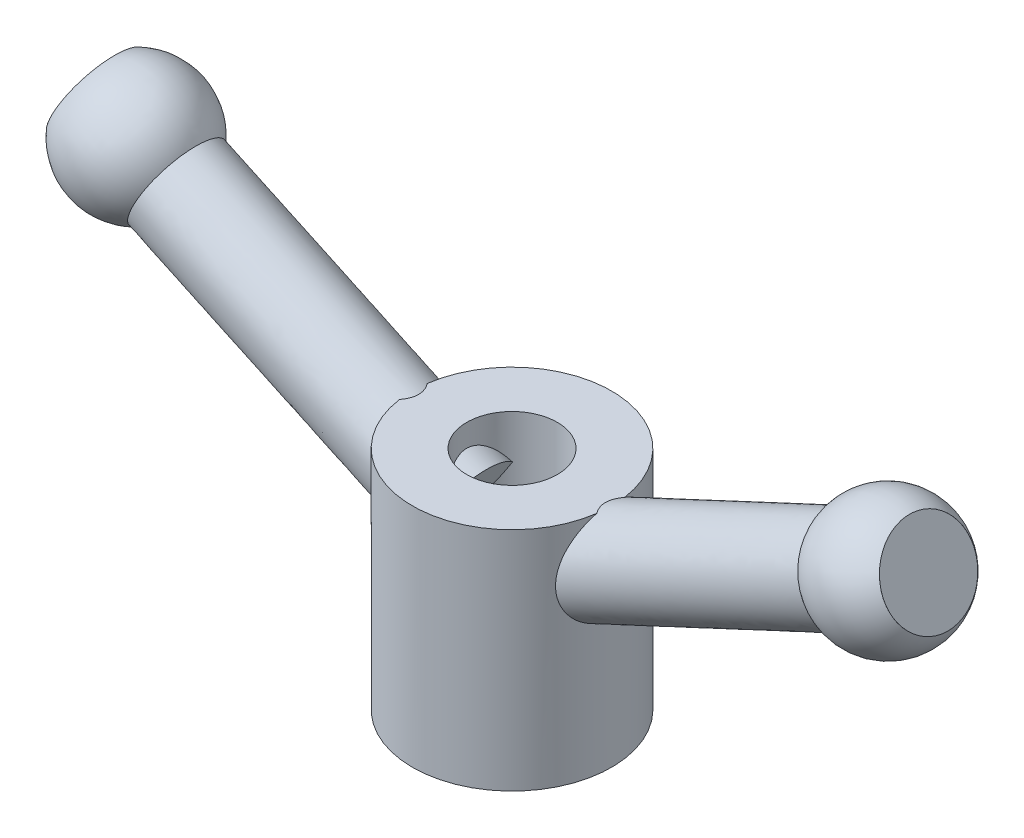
ISO-10303-21;
HEADER;
FILE_DESCRIPTION(('STEP AP214'),'2;1');
FILE_NAME('part.step','',(''),(''),'','','');
FILE_SCHEMA(('AUTOMOTIVE_DESIGN { 1 0 10303 214 1 1 1 1 }'));
ENDSEC;
DATA;
#1=APPLICATION_CONTEXT('core data for automotive mechanical design processes');
#2=APPLICATION_PROTOCOL_DEFINITION('international standard','automotive_design',2000,#1);
#3=PRODUCT_CONTEXT('',#1,'mechanical');
#4=PRODUCT('Part','Part','',(#3));
#5=PRODUCT_RELATED_PRODUCT_CATEGORY('part','',(#4));
#6=PRODUCT_DEFINITION_FORMATION('','',#4);
#7=PRODUCT_DEFINITION_CONTEXT('part definition',#1,'design');
#8=PRODUCT_DEFINITION('design','',#6,#7);
#9=PRODUCT_DEFINITION_SHAPE('','',#8);
#10=(LENGTH_UNIT() NAMED_UNIT(*) SI_UNIT(.MILLI.,.METRE.));
#11=(NAMED_UNIT(*) PLANE_ANGLE_UNIT() SI_UNIT($,.RADIAN.));
#12=(NAMED_UNIT(*) SI_UNIT($,.STERADIAN.) SOLID_ANGLE_UNIT());
#13=UNCERTAINTY_MEASURE_WITH_UNIT(LENGTH_MEASURE(1.E-05),#10,'distance_accuracy_value','');
#14=(GEOMETRIC_REPRESENTATION_CONTEXT(3) GLOBAL_UNCERTAINTY_ASSIGNED_CONTEXT((#13)) GLOBAL_UNIT_ASSIGNED_CONTEXT((#10,
#11,#12)) REPRESENTATION_CONTEXT('',''));
#15=CARTESIAN_POINT('',(0.,0.,0.));
#16=DIRECTION('',(0.,0.,1.));
#17=DIRECTION('',(1.,0.,0.));
#18=AXIS2_PLACEMENT_3D('',#15,#16,#17);
#19=CARTESIAN_POINT('',(-65.8965822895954,54.0142639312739,0.));
#20=DIRECTION('',(0.906307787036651,-0.422618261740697,0.));
#21=DIRECTION('',(0.422618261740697,0.906307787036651,0.));
#22=AXIS2_PLACEMENT_3D('',#19,#20,#21);
#23=DEGENERATE_TOROIDAL_SURFACE('',#22,0.0873978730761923,11.1125,.T.);
#24=CARTESIAN_POINT('',(-73.025,57.3382997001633,0.));
#25=DIRECTION('',(0.906307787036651,-0.422618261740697,0.));
#26=DIRECTION('',(0.422618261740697,0.906307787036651,0.));
#27=AXIS2_PLACEMENT_3D('',#24,#25,#26);
#28=CIRCLE('',#27,7.9375);
#29=CARTESIAN_POINT('',(-69.6704675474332,64.5321177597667,0.));
#30=VERTEX_POINT('',#29);
#31=EDGE_CURVE('E47',#30,#30,#28,.T.);
#32=ORIENTED_EDGE('',*,*,#31,.T.);
#33=EDGE_LOOP('',(#32));
#34=FACE_BOUND('',#33,.T.);
#35=CARTESIAN_POINT('',(-58.7681645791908,50.6902281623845,0.));
#36=DIRECTION('',(0.906307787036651,-0.422618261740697,0.));
#37=DIRECTION('',(0.422618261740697,0.906307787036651,0.));
#38=AXIS2_PLACEMENT_3D('',#35,#36,#37);
#39=CIRCLE('',#38,7.9375);
#40=CARTESIAN_POINT('',(-55.413632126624,57.884046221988,0.));
#41=VERTEX_POINT('',#40);
#42=EDGE_CURVE('E11',#41,#41,#39,.T.);
#43=ORIENTED_EDGE('',*,*,#42,.F.);
#44=EDGE_LOOP('',(#43));
#45=FACE_BOUND('',#44,.T.);
#46=ADVANCED_FACE('F41',(#34,#45),#23,.T.);
#47=CARTESIAN_POINT('',(-7.9375,26.9875,0.));
#48=DIRECTION('',(0.906307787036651,-0.422618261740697,0.));
#49=DIRECTION('',(0.422618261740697,0.906307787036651,0.));
#50=AXIS2_PLACEMENT_3D('',#47,#48,#49);
#51=CYLINDRICAL_SURFACE('',#50,7.9375);
#52=CARTESIAN_POINT('',(-55.413632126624,57.884046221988,0.));
#53=CARTESIAN_POINT('',(-55.5621408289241,57.9532969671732,0.));
#54=CARTESIAN_POINT('',(-55.7106495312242,58.0225477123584,0.));
#55=CARTESIAN_POINT('',(-56.0076669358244,58.1610492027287,0.));
#56=CARTESIAN_POINT('',(-56.1561756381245,58.2302999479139,0.));
#57=CARTESIAN_POINT('',(-56.4531930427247,58.3688014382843,0.));
#58=CARTESIAN_POINT('',(-56.6017017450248,58.4380521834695,0.));
#59=CARTESIAN_POINT('',(-56.898719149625,58.5765536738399,0.));
#60=CARTESIAN_POINT('',(-57.047227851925,58.6458044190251,0.));
#61=CARTESIAN_POINT('',(-57.3442452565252,58.7843059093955,0.));
#62=CARTESIAN_POINT('',(-57.4927539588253,58.8535566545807,0.));
#63=CARTESIAN_POINT('',(-57.7897713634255,58.9920581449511,0.));
#64=CARTESIAN_POINT('',(-57.9382800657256,59.0613088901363,0.));
#65=CARTESIAN_POINT('',(-58.2352974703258,59.1998103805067,0.));
#66=CARTESIAN_POINT('',(-58.3838061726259,59.2690611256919,0.));
#67=CARTESIAN_POINT('',(-58.6808235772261,59.4075626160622,0.));
#68=CARTESIAN_POINT('',(-58.8293322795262,59.4768133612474,0.));
#69=CARTESIAN_POINT('',(-59.1263496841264,59.6153148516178,0.));
#70=CARTESIAN_POINT('',(-59.2748583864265,59.684565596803,0.));
#71=CARTESIAN_POINT('',(-59.5718757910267,59.8230670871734,0.));
#72=CARTESIAN_POINT('',(-59.7203844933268,59.8923178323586,0.));
#73=CARTESIAN_POINT('',(-60.017401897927,60.030819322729,0.));
#74=CARTESIAN_POINT('',(-60.1659106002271,60.1000700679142,0.));
#75=CARTESIAN_POINT('',(-60.4629280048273,60.2385715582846,0.));
#76=CARTESIAN_POINT('',(-60.6114367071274,60.3078223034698,0.));
#77=CARTESIAN_POINT('',(-60.9084541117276,60.4463237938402,0.));
#78=CARTESIAN_POINT('',(-61.0569628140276,60.5155745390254,0.));
#79=CARTESIAN_POINT('',(-61.3539802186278,60.6540760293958,0.));
#80=CARTESIAN_POINT('',(-61.5024889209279,60.723326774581,0.));
#81=CARTESIAN_POINT('',(-61.7995063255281,60.8618282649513,0.));
#82=CARTESIAN_POINT('',(-61.9480150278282,60.9310790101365,0.));
#83=CARTESIAN_POINT('',(-62.2450324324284,61.0695805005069,0.));
#84=CARTESIAN_POINT('',(-62.3935411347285,61.1388312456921,0.));
#85=CARTESIAN_POINT('',(-62.6905585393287,61.2773327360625,0.));
#86=CARTESIAN_POINT('',(-62.8390672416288,61.3465834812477,0.));
#87=CARTESIAN_POINT('',(-63.136084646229,61.4850849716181,0.));
#88=CARTESIAN_POINT('',(-63.2845933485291,61.5543357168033,0.));
#89=CARTESIAN_POINT('',(-63.5816107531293,61.6928372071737,0.));
#90=CARTESIAN_POINT('',(-63.7301194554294,61.7620879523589,0.));
#91=CARTESIAN_POINT('',(-64.0271368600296,61.9005894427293,0.));
#92=CARTESIAN_POINT('',(-64.1756455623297,61.9698401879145,0.));
#93=CARTESIAN_POINT('',(-64.4726629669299,62.1083416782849,0.));
#94=CARTESIAN_POINT('',(-64.62117166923,62.1775924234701,0.));
#95=CARTESIAN_POINT('',(-64.9181890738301,62.3160939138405,0.));
#96=CARTESIAN_POINT('',(-65.0666977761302,62.3853446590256,0.));
#97=CARTESIAN_POINT('',(-65.3637151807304,62.523846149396,0.));
#98=CARTESIAN_POINT('',(-65.5122238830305,62.5930968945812,0.));
#99=CARTESIAN_POINT('',(-65.8092412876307,62.7315983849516,0.));
#100=CARTESIAN_POINT('',(-65.9577499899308,62.8008491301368,0.));
#101=CARTESIAN_POINT('',(-66.254767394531,62.9393506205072,0.));
#102=CARTESIAN_POINT('',(-66.4032760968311,63.0086013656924,0.));
#103=CARTESIAN_POINT('',(-66.7002935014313,63.1471028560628,0.));
#104=CARTESIAN_POINT('',(-66.8488022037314,63.216353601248,0.));
#105=CARTESIAN_POINT('',(-67.1458196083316,63.3548550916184,0.));
#106=CARTESIAN_POINT('',(-67.2943283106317,63.4241058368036,0.));
#107=CARTESIAN_POINT('',(-67.5913457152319,63.562607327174,0.));
#108=CARTESIAN_POINT('',(-67.739854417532,63.6318580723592,0.));
#109=CARTESIAN_POINT('',(-68.0368718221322,63.7703595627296,0.));
#110=CARTESIAN_POINT('',(-68.1853805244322,63.8396103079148,0.));
#111=CARTESIAN_POINT('',(-68.4823979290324,63.9781117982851,0.));
#112=CARTESIAN_POINT('',(-68.6309066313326,64.0473625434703,0.));
#113=CARTESIAN_POINT('',(-68.9279240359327,64.1858640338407,0.));
#114=CARTESIAN_POINT('',(-69.0764327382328,64.2551147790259,0.));
#115=CARTESIAN_POINT('',(-69.373450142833,64.3936162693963,0.));
#116=CARTESIAN_POINT('',(-69.5219588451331,64.4628670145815,0.));
#117=CARTESIAN_POINT('',(-69.6704675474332,64.5321177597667,0.));
#118=B_SPLINE_CURVE_WITH_KNOTS('',3,(#52,#53,#54,#55,#56,#57,#58,#59,#60,#61,#62,#63,#64,#65,
#66,#67,#68,#69,#70,#71,#72,#73,#74,#75,#76,#77,#78,#79,#80,#81,#82,#83,#84,#85,#86,#87,#88,#89,
#90,#91,#92,#93,#94,#95,#96,#97,#98,#99,#100,#101,#102,#103,#104,#105,#106,#107,#108,#109,#110,
#111,#112,#113,#114,#115,#116,#117),.UNSPECIFIED.,.F.,.F.,(4,2,2,2,2,2,2,2,2,2,2,2,2,2,2,2,2,2,
2,2,2,2,2,2,2,2,2,2,2,2,2,2,4),(0.,0.491583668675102,0.983167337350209,1.4747510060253,
1.9663346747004,2.45791834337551,2.94950201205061,3.4410856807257,3.93266934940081,
4.42425301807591,4.91583668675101,5.4074203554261,5.89900402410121,6.39058769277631,
6.88217136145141,7.37375503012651,7.86533869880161,8.3569223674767,8.84850603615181,
9.3400897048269,9.83167337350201,10.3232570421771,10.8148407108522,11.3064243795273,
11.7980080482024,12.2895917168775,12.7811753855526,13.2727590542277,13.7643427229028,
14.2559263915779,14.747510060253,15.2390937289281,15.7306773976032),.UNSPECIFIED.);
#119=EDGE_CURVE('BSEAM55',#41,#30,#118,.T.);
#120=ORIENTED_EDGE('',*,*,#42,.T.);
#121=ORIENTED_EDGE('',*,*,#31,.F.);
#122=ORIENTED_EDGE('',*,*,#119,.T.);
#123=ORIENTED_EDGE('',*,*,#119,.F.);
#124=EDGE_LOOP('',(#120,#122,#121,#123));
#125=FACE_BOUND('',#124,.T.);
#126=ADVANCED_FACE('F55',(#125),#51,.F.);
#127=CLOSED_SHELL('',(#46,#126));
#128=MANIFOLD_SOLID_BREP('B2',#127);
#129=CARTESIAN_POINT('',(65.8967551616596,54.0143445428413,0.));
#130=DIRECTION('',(-0.906307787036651,-0.422618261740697,0.));
#131=DIRECTION('',(0.422618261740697,-0.906307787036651,0.));
#132=AXIS2_PLACEMENT_3D('',#129,#130,#131);
#133=DEGENERATE_TOROIDAL_SURFACE('',#132,0.0872067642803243,11.1125,.T.);
#134=CARTESIAN_POINT('',(73.025,57.3382997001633,0.));
#135=DIRECTION('',(-0.906307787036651,-0.422618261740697,0.));
#136=DIRECTION('',(0.422618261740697,-0.906307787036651,0.));
#137=AXIS2_PLACEMENT_3D('',#134,#135,#136);
#138=CIRCLE('',#137,7.9375);
#139=CARTESIAN_POINT('',(76.3795324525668,50.1444816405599,0.));
#140=VERTEX_POINT('',#139);
#141=EDGE_CURVE('E87',#140,#140,#138,.T.);
#142=ORIENTED_EDGE('',*,*,#141,.T.);
#143=EDGE_LOOP('',(#142));
#144=FACE_BOUND('',#143,.T.);
#145=CARTESIAN_POINT('',(58.7685103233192,50.6903893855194,0.));
#146=DIRECTION('',(-0.906307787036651,-0.422618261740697,0.));
#147=DIRECTION('',(0.422618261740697,-0.906307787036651,0.));
#148=AXIS2_PLACEMENT_3D('',#145,#146,#147);
#149=CIRCLE('',#148,7.9375);
#150=CARTESIAN_POINT('',(62.123042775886,43.496571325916,0.));
#151=VERTEX_POINT('',#150);
#152=EDGE_CURVE('E40',#151,#151,#149,.T.);
#153=ORIENTED_EDGE('',*,*,#152,.F.);
#154=EDGE_LOOP('',(#153));
#155=FACE_BOUND('',#154,.T.);
#156=ADVANCED_FACE('F81',(#144,#155),#133,.T.);
#157=CARTESIAN_POINT('',(7.93749999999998,26.9875,0.));
#158=DIRECTION('',(-0.906307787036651,-0.422618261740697,0.));
#159=DIRECTION('',(0.422618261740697,-0.906307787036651,0.));
#160=AXIS2_PLACEMENT_3D('',#157,#158,#159);
#161=CYLINDRICAL_SURFACE('',#160,7.9375);
#162=ORIENTED_EDGE('',*,*,#152,.T.);
#163=EDGE_LOOP('',(#162));
#164=FACE_BOUND('',#163,.T.);
#165=ORIENTED_EDGE('',*,*,#141,.F.);
#166=EDGE_LOOP('',(#165));
#167=FACE_BOUND('',#166,.T.);
#168=ADVANCED_FACE('F95',(#164,#167),#161,.F.);
#169=CLOSED_SHELL('',(#156,#168));
#170=MANIFOLD_SOLID_BREP('B6',#169);
#171=CARTESIAN_POINT('',(0.,39.6875,0.));
#172=DIRECTION('',(0.,1.,0.));
#173=DIRECTION('',(0.,0.,1.));
#174=AXIS2_PLACEMENT_3D('',#171,#172,#173);
#175=PLANE('',#174);
#176=CARTESIAN_POINT('',(0.,39.6875,0.));
#177=DIRECTION('',(0.,1.,0.));
#178=DIRECTION('',(0.,0.,1.));
#179=AXIS2_PLACEMENT_3D('',#176,#177,#178);
#180=CIRCLE('',#179,7.9375);
#181=CARTESIAN_POINT('',(0.,39.6875,7.9375));
#182=VERTEX_POINT('',#181);
#183=EDGE_CURVE('E277',#182,#182,#180,.T.);
#184=ORIENTED_EDGE('',*,*,#183,.F.);
#185=EDGE_LOOP('',(#184));
#186=FACE_BOUND('',#185,.T.);
#187=CARTESIAN_POINT('',(0.,39.6875,0.));
#188=DIRECTION('',(0.,1.,0.));
#189=DIRECTION('',(0.,0.,1.));
#190=AXIS2_PLACEMENT_3D('',#187,#188,#189);
#191=CIRCLE('',#190,17.4625);
#192=CARTESIAN_POINT('',(-17.2926446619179,39.6875,2.42968040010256));
#193=VERTEX_POINT('',#192);
#194=CARTESIAN_POINT('',(17.2926446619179,39.6875,2.42968040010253));
#195=VERTEX_POINT('',#194);
#196=EDGE_CURVE('E264',#193,#195,#191,.T.);
#197=ORIENTED_EDGE('',*,*,#196,.T.);
#198=CARTESIAN_POINT('',(17.6710308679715,39.6875,2.88002561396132));
#199=CARTESIAN_POINT('',(17.5925115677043,39.6875,2.79478829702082));
#200=CARTESIAN_POINT('',(17.5161233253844,39.6875,2.70753224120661));
#201=CARTESIAN_POINT('',(17.3683082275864,39.6875,2.52875266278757));
#202=CARTESIAN_POINT('',(17.296887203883,39.6875,2.43722432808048));
#203=CARTESIAN_POINT('',(17.1589630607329,39.6875,2.24859768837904));
#204=CARTESIAN_POINT('',(17.0925396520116,39.6875,2.15144073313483));
#205=CARTESIAN_POINT('',(16.9666941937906,39.6875,1.95271217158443));
#206=CARTESIAN_POINT('',(16.907270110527,39.6875,1.85114185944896));
#207=CARTESIAN_POINT('',(16.7960601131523,39.6875,1.64288402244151));
#208=CARTESIAN_POINT('',(16.7443355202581,39.6875,1.5361635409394));
#209=CARTESIAN_POINT('',(16.6502591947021,39.6875,1.31867517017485));
#210=CARTESIAN_POINT('',(16.6079048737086,39.6875,1.207908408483));
#211=CARTESIAN_POINT('',(16.5339123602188,39.6875,0.983477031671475));
#212=CARTESIAN_POINT('',(16.5022186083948,39.6875,0.869830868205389));
#213=CARTESIAN_POINT('',(16.4502550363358,39.6875,0.639950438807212));
#214=CARTESIAN_POINT('',(16.4299832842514,39.6875,0.523716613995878));
#215=CARTESIAN_POINT('',(16.4026939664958,39.6875,0.29895882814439));
#216=CARTESIAN_POINT('',(16.3947608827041,39.6875,0.19054588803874));
#217=CARTESIAN_POINT('',(16.3894548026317,39.6875,-0.0265388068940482));
#218=CARTESIAN_POINT('',(16.3920813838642,39.6875,-0.1352105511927));
#219=CARTESIAN_POINT('',(16.4078159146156,39.6875,-0.351885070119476));
#220=CARTESIAN_POINT('',(16.4209334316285,39.6875,-0.459887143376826));
#221=CARTESIAN_POINT('',(16.4572467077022,39.6875,-0.674170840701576));
#222=CARTESIAN_POINT('',(16.4804422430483,39.6875,-0.78045250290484));
#223=CARTESIAN_POINT('',(16.5329038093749,39.6875,-0.977964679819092));
#224=CARTESIAN_POINT('',(16.5611156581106,39.6875,-1.06947828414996));
#225=CARTESIAN_POINT('',(16.6242635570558,39.6875,-1.25016784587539));
#226=CARTESIAN_POINT('',(16.6592017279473,39.6875,-1.3393430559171));
#227=CARTESIAN_POINT('',(16.773278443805,39.6875,-1.60308604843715));
#228=CARTESIAN_POINT('',(16.8616359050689,39.6875,-1.77371458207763));
#229=CARTESIAN_POINT('',(17.0609802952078,39.6875,-2.10828611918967));
#230=CARTESIAN_POINT('',(17.1725918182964,39.6875,-2.27184979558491));
#231=CARTESIAN_POINT('',(17.3517138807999,39.6875,-2.50733737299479));
#232=CARTESIAN_POINT('',(17.4131691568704,39.6875,-2.58397370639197));
#233=CARTESIAN_POINT('',(17.5395776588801,39.6875,-2.73422264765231));
#234=CARTESIAN_POINT('',(17.6045285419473,39.6875,-2.80783722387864));
#235=CARTESIAN_POINT('',(17.6710308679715,39.6875,-2.88002561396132));
#236=B_SPLINE_CURVE_WITH_KNOTS('',3,(#198,#199,#200,#201,#202,#203,#204,#205,#206,#207,#208,
#209,#210,#211,#212,#213,#214,#215,#216,#217,#218,#219,#220,#221,#222,#223,#224,#225,#226,#227,
#228,#229,#230,#231,#232,#233,#234,#235),.UNSPECIFIED.,.F.,.F.,(4,2,2,2,2,2,2,2,2,2,2,2,2,2,2,2,
2,2,4),(0.,0.347696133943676,0.695793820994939,1.04860620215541,1.40131581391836,
1.75669936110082,2.11198461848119,2.46538847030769,2.81873253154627,3.14433964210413,
3.46993372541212,3.79582508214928,4.12170920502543,4.40871979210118,4.69582101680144,
5.27050638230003,5.86327543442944,6.15788740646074,6.45230432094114),.UNSPECIFIED.);
#237=CARTESIAN_POINT('',(17.2926446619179,39.6875,-2.42968040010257));
#238=VERTEX_POINT('',#237);
#239=EDGE_CURVE('E204',#195,#238,#236,.T.);
#240=ORIENTED_EDGE('',*,*,#239,.T.);
#241=CARTESIAN_POINT('',(-17.2926446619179,39.6875,-2.42968040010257));
#242=VERTEX_POINT('',#241);
#243=EDGE_CURVE('E265',#238,#242,#191,.T.);
#244=ORIENTED_EDGE('',*,*,#243,.T.);
#245=CARTESIAN_POINT('',(-17.67205,39.6875,2.88113152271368));
#246=CARTESIAN_POINT('',(-17.5935013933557,39.6875,2.7959000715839));
#247=CARTESIAN_POINT('',(-17.5170830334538,39.6875,2.70864976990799));
#248=CARTESIAN_POINT('',(-17.3692059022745,39.6875,2.52988121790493));
#249=CARTESIAN_POINT('',(-17.2977529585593,39.6875,2.4383581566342));
#250=CARTESIAN_POINT('',(-17.1597622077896,39.6875,2.24974082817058));
#251=CARTESIAN_POINT('',(-17.0933041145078,39.6875,2.15258787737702));
#252=CARTESIAN_POINT('',(-16.9673872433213,39.6875,1.95386594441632));
#253=CARTESIAN_POINT('',(-16.9079264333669,39.6875,1.85229825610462));
#254=CARTESIAN_POINT('',(-16.7966409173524,39.6875,1.64404405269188));
#255=CARTESIAN_POINT('',(-16.744877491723,39.6875,1.53732457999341));
#256=CARTESIAN_POINT('',(-16.6507218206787,39.6875,1.31983555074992));
#257=CARTESIAN_POINT('',(-16.6083269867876,39.6875,1.20906712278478));
#258=CARTESIAN_POINT('',(-16.5342526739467,39.6875,0.984628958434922));
#259=CARTESIAN_POINT('',(-16.5025176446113,39.6875,0.870977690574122));
#260=CARTESIAN_POINT('',(-16.4504716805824,39.6875,0.641083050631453));
#261=CARTESIAN_POINT('',(-16.4301588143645,39.6875,0.524840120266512));
#262=CARTESIAN_POINT('',(-16.402790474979,39.6875,0.300047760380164));
#263=CARTESIAN_POINT('',(-16.3948206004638,39.6875,0.191609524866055));
#264=CARTESIAN_POINT('',(-16.3894460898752,39.6875,-0.0255291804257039));
#265=CARTESIAN_POINT('',(-16.3920410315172,39.6875,-0.134229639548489));
#266=CARTESIAN_POINT('',(-16.4077183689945,39.6875,-0.350963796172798));
#267=CARTESIAN_POINT('',(-16.4208103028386,39.6875,-0.458996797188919));
#268=CARTESIAN_POINT('',(-16.4570790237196,39.6875,-0.673343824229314));
#269=CARTESIAN_POINT('',(-16.4802555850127,39.6875,-0.779657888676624));
#270=CARTESIAN_POINT('',(-16.5326805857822,39.6875,-0.977204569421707));
#271=CARTESIAN_POINT('',(-16.5608719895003,39.6875,-1.06872080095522));
#272=CARTESIAN_POINT('',(-16.623980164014,39.6875,-1.24941677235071));
#273=CARTESIAN_POINT('',(-16.6588990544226,39.6875,-1.33859576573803));
#274=CARTESIAN_POINT('',(-16.7729202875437,39.6875,-1.60235237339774));
#275=CARTESIAN_POINT('',(-16.8612436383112,39.6875,-1.77299190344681));
#276=CARTESIAN_POINT('',(-17.0607279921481,39.6875,-2.10792901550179));
#277=CARTESIAN_POINT('',(-17.1725556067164,39.6875,-2.27182193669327));
#278=CARTESIAN_POINT('',(-17.3520457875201,39.6875,-2.5077638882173));
#279=CARTESIAN_POINT('',(-17.4136302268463,39.6875,-2.58454427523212));
#280=CARTESIAN_POINT('',(-17.5403091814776,39.6875,-2.73506942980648));
#281=CARTESIAN_POINT('',(-17.6054013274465,39.6875,-2.8088161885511));
#282=CARTESIAN_POINT('',(-17.67205,39.6875,-2.88113152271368));
#283=B_SPLINE_CURVE_WITH_KNOTS('',3,(#245,#246,#247,#248,#249,#250,#251,#252,#253,#254,#255,
#256,#257,#258,#259,#260,#261,#262,#263,#264,#265,#266,#267,#268,#269,#270,#271,#272,#273,#274,
#275,#276,#277,#278,#279,#280,#281,#282),.UNSPECIFIED.,.F.,.F.,(4,2,2,2,2,2,2,2,2,2,2,2,2,2,2,2,
2,2,4),(0.,0.347742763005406,0.69588698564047,1.04874829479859,1.40150687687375,
1.75693864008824,2.1122720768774,2.46572398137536,2.81911609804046,3.14480662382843,
3.47048413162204,3.79645789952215,4.12242437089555,4.40942439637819,4.69651499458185,
5.27118246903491,5.86512409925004,6.16031523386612,6.45530941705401),.UNSPECIFIED.);
#284=EDGE_CURVE('E197',#193,#242,#283,.T.);
#285=ORIENTED_EDGE('',*,*,#284,.F.);
#286=EDGE_LOOP('',(#197,#240,#244,#285));
#287=FACE_BOUND('',#286,.T.);
#288=ADVANCED_FACE('F112',(#186,#287),#175,.T.);
#289=CARTESIAN_POINT('',(0.,39.6875,0.));
#290=DIRECTION('',(0.,-1.,0.));
#291=DIRECTION('',(0.,0.,-1.));
#292=AXIS2_PLACEMENT_3D('',#289,#290,#291);
#293=CYLINDRICAL_SURFACE('',#292,17.4625);
#294=CARTESIAN_POINT('',(0.,0.,0.));
#295=DIRECTION('',(0.,1.,0.));
#296=DIRECTION('',(0.,0.,1.));
#297=AXIS2_PLACEMENT_3D('',#294,#295,#296);
#298=CIRCLE('',#297,17.4625);
#299=CARTESIAN_POINT('',(0.,0.,17.4625));
#300=VERTEX_POINT('',#299);
#301=EDGE_CURVE('E272',#300,#300,#298,.T.);
#302=ORIENTED_EDGE('',*,*,#301,.T.);
#303=EDGE_LOOP('',(#302));
#304=FACE_BOUND('',#303,.T.);
#305=CARTESIAN_POINT('',(17.2926446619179,39.6875,2.42968040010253));
#306=CARTESIAN_POINT('',(17.2631976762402,39.5993943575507,2.63931244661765));
#307=CARTESIAN_POINT('',(17.2305668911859,39.5010009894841,2.84383801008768));
#308=CARTESIAN_POINT('',(17.1601432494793,39.2859157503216,3.24177463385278));
#309=CARTESIAN_POINT('',(17.1223571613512,39.1692478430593,3.4351998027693));
#310=CARTESIAN_POINT('',(17.0021632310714,38.7924155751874,4.00193738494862));
#311=CARTESIAN_POINT('',(16.91353819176,38.5072205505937,4.35759879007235));
#312=CARTESIAN_POINT('',(16.7752631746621,38.0420699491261,4.85377389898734));
#313=CARTESIAN_POINT('',(16.7282110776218,37.8805365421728,5.01314639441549));
#314=CARTESIAN_POINT('',(16.6333017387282,37.5463957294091,5.31957288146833));
#315=CARTESIAN_POINT('',(16.5854447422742,37.3737916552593,5.46663054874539));
#316=CARTESIAN_POINT('',(16.4863833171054,37.0058365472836,5.75878416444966));
#317=CARTESIAN_POINT('',(16.4351903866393,36.8097453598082,5.90294789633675));
#318=CARTESIAN_POINT('',(16.3341495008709,36.4079317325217,6.17703506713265));
#319=CARTESIAN_POINT('',(16.284299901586,36.2022219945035,6.30697656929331));
#320=CARTESIAN_POINT('',(16.1757602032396,35.7338289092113,6.58104300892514));
#321=CARTESIAN_POINT('',(16.1176656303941,35.4689017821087,6.72158278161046));
#322=CARTESIAN_POINT('',(16.0069371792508,34.9276229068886,6.98117312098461));
#323=CARTESIAN_POINT('',(15.9543035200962,34.6512707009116,7.10022282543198));
#324=CARTESIAN_POINT('',(15.8582339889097,34.0991809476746,7.31220589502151));
#325=CARTESIAN_POINT('',(15.8145299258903,33.8237987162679,7.40594235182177));
#326=CARTESIAN_POINT('',(15.735710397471,33.2654806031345,7.57197340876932));
#327=CARTESIAN_POINT('',(15.7005927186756,32.982546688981,7.64427353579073));
#328=CARTESIAN_POINT('',(15.6438021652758,32.4409114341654,7.75977097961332));
#329=CARTESIAN_POINT('',(15.6211020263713,32.1828009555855,7.80523324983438));
#330=CARTESIAN_POINT('',(15.5850827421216,31.6632407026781,7.8769112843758));
#331=CARTESIAN_POINT('',(15.5717629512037,31.4017911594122,7.90312837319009));
#332=CARTESIAN_POINT('',(15.5563538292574,30.9046931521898,7.93341091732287));
#333=CARTESIAN_POINT('',(15.5532373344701,30.6692002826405,7.93950301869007));
#334=CARTESIAN_POINT('',(15.5558706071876,30.1985021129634,7.9343442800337));
#335=CARTESIAN_POINT('',(15.5616170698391,29.9632967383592,7.92309990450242));
#336=CARTESIAN_POINT('',(15.5814322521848,29.5135191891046,7.88405382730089));
#337=CARTESIAN_POINT('',(15.59480166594,29.2987957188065,7.85764221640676));
#338=CARTESIAN_POINT('',(15.629275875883,28.8723171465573,7.78884642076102));
#339=CARTESIAN_POINT('',(15.650388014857,28.6605650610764,7.74644707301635));
#340=CARTESIAN_POINT('',(15.6992409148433,28.2485947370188,7.64694094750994));
#341=CARTESIAN_POINT('',(15.7267473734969,28.0482243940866,7.590349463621));
#342=CARTESIAN_POINT('',(15.7881819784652,27.6534173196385,7.46172192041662));
#343=CARTESIAN_POINT('',(15.8221126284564,27.4589829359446,7.38967983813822));
#344=CARTESIAN_POINT('',(15.8955744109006,27.077668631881,7.23030490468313));
#345=CARTESIAN_POINT('',(15.9351034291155,26.8907858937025,7.14297782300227));
#346=CARTESIAN_POINT('',(16.0187369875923,26.5259275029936,6.95339432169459));
#347=CARTESIAN_POINT('',(16.0628396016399,26.3479481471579,6.85114417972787));
#348=CARTESIAN_POINT('',(16.1535604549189,26.0053854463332,6.63437390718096));
#349=CARTESIAN_POINT('',(16.2001129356,25.840608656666,6.52013166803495));
#350=CARTESIAN_POINT('',(16.2952857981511,25.521661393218,6.27848880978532));
#351=CARTESIAN_POINT('',(16.3439060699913,25.3674903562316,6.15108889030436));
#352=CARTESIAN_POINT('',(16.4425987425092,25.0686445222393,5.88222862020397));
#353=CARTESIAN_POINT('',(16.4926817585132,24.9241161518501,5.74060947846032));
#354=CARTESIAN_POINT('',(16.5924330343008,24.6473556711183,5.44557861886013));
#355=CARTESIAN_POINT('',(16.6421011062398,24.5151288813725,5.29216185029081));
#356=CARTESIAN_POINT('',(16.7397891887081,24.2635182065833,4.97453310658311));
#357=CARTESIAN_POINT('',(16.7878084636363,24.1441400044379,4.81031640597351));
#358=CARTESIAN_POINT('',(16.8810034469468,23.9187625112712,4.47228719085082));
#359=CARTESIAN_POINT('',(16.9261802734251,23.8127579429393,4.29847850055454));
#360=CARTESIAN_POINT('',(17.0138845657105,23.6116031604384,3.93727587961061));
#361=CARTESIAN_POINT('',(17.0563010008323,23.5168446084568,3.74963678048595));
#362=CARTESIAN_POINT('',(17.1359865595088,23.3421527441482,3.36675952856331));
#363=CARTESIAN_POINT('',(17.1732606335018,23.2622051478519,3.17152891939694));
#364=CARTESIAN_POINT('',(17.2418552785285,23.1172320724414,2.7745136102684));
#365=CARTESIAN_POINT('',(17.2731738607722,23.0522115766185,2.57272674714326));
#366=CARTESIAN_POINT('',(17.3291330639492,22.9373012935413,2.16393668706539));
#367=CARTESIAN_POINT('',(17.3537722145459,22.8874148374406,1.95693235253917));
#368=CARTESIAN_POINT('',(17.3958061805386,22.8029387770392,1.53912633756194));
#369=CARTESIAN_POINT('',(17.4132018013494,22.7683474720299,1.32832508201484));
#370=CARTESIAN_POINT('',(17.4403645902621,22.7145524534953,0.904282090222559));
#371=CARTESIAN_POINT('',(17.4501317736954,22.6953487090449,0.691040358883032));
#372=CARTESIAN_POINT('',(17.4618217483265,22.6723825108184,0.26348898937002));
#373=CARTESIAN_POINT('',(17.4637436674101,22.6686217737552,0.0491792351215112));
#374=CARTESIAN_POINT('',(17.4596986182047,22.6765562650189,-0.379033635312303));
#375=CARTESIAN_POINT('',(17.4537333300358,22.6882482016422,-0.59293682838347));
#376=CARTESIAN_POINT('',(17.4340524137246,22.7270417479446,-1.01890401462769));
#377=CARTESIAN_POINT('',(17.4203395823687,22.7541377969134,-1.23096864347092));
#378=CARTESIAN_POINT('',(17.3854542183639,22.8236900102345,-1.65214476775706));
#379=CARTESIAN_POINT('',(17.3642747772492,22.8661604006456,-1.86125334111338));
#380=CARTESIAN_POINT('',(17.3146093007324,22.9669940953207,-2.27766336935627));
#381=CARTESIAN_POINT('',(17.2860310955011,23.0255585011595,-2.4849051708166));
#382=CARTESIAN_POINT('',(17.2223589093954,23.1581822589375,-2.8934444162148));
#383=CARTESIAN_POINT('',(17.1872620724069,23.2322484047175,-3.09473920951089));
#384=CARTESIAN_POINT('',(17.1113933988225,23.3956376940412,-3.48992918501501));
#385=CARTESIAN_POINT('',(17.0706216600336,23.484960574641,-3.68382449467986));
#386=CARTESIAN_POINT('',(16.9844102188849,23.6785431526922,-4.06281534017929));
#387=CARTESIAN_POINT('',(16.9389726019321,23.7827961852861,-4.24791475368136));
#388=CARTESIAN_POINT('',(16.8440415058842,24.0071124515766,-4.61005266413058));
#389=CARTESIAN_POINT('',(16.7945099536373,24.1273323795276,-4.78698419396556));
#390=CARTESIAN_POINT('',(16.6931639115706,24.3821419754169,-5.12923101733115));
#391=CARTESIAN_POINT('',(16.6413515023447,24.5167187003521,-5.29455655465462));
#392=CARTESIAN_POINT('',(16.5390239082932,24.7937611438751,-5.60582701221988));
#393=CARTESIAN_POINT('',(16.4885465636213,24.935652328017,-5.7522959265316));
#394=CARTESIAN_POINT('',(16.3880531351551,25.2315267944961,-6.03264434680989));
#395=CARTESIAN_POINT('',(16.3380370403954,25.3855097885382,-6.16652415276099));
#396=CARTESIAN_POINT('',(16.2408464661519,25.7013415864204,-6.41806891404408));
#397=CARTESIAN_POINT('',(16.1936340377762,25.862950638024,-6.53602021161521));
#398=CARTESIAN_POINT('',(16.1021033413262,26.1961987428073,-6.75837605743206));
#399=CARTESIAN_POINT('',(16.0577872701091,26.3678452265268,-6.86277038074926));
#400=CARTESIAN_POINT('',(15.972893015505,26.7213920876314,-7.05811846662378));
#401=CARTESIAN_POINT('',(15.9323476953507,26.9033637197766,-7.14895760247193));
#402=CARTESIAN_POINT('',(15.8564185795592,27.2751053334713,-7.31582596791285));
#403=CARTESIAN_POINT('',(15.8210369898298,27.4648786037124,-7.39184887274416));
#404=CARTESIAN_POINT('',(15.7562910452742,27.8508138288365,-7.52887427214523));
#405=CARTESIAN_POINT('',(15.7269281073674,28.0469772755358,-7.58987323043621));
#406=CARTESIAN_POINT('',(15.6748506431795,28.4441292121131,-7.69685030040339));
#407=CARTESIAN_POINT('',(15.6521335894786,28.6451158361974,-7.7428341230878));
#408=CARTESIAN_POINT('',(15.613730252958,29.0501506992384,-7.81998641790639));
#409=CARTESIAN_POINT('',(15.5980303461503,29.2541922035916,-7.85118360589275));
#410=CARTESIAN_POINT('',(15.5737234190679,29.6641606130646,-7.89928915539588));
#411=CARTESIAN_POINT('',(15.5651097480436,29.870085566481,-7.91621091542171));
#412=CARTESIAN_POINT('',(15.5548519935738,30.2827178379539,-7.9363474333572));
#413=CARTESIAN_POINT('',(15.5532064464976,30.4894249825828,-7.93956506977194));
#414=CARTESIAN_POINT('',(15.5566059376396,30.9025965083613,-7.93290160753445));
#415=CARTESIAN_POINT('',(15.5616522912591,31.1090608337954,-7.92301793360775));
#416=CARTESIAN_POINT('',(15.5780252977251,31.5206052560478,-7.8907768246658));
#417=CARTESIAN_POINT('',(15.5893475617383,31.7256862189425,-7.86842810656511));
#418=CARTESIAN_POINT('',(15.6177709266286,32.1337920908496,-7.81185826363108));
#419=CARTESIAN_POINT('',(15.6348725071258,32.336816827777,-7.77763615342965));
#420=CARTESIAN_POINT('',(15.6828869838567,32.8278758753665,-7.68049960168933));
#421=CARTESIAN_POINT('',(15.716571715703,33.1144685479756,-7.61157971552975));
#422=CARTESIAN_POINT('',(15.7929829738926,33.6802544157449,-7.45173958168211));
#423=CARTESIAN_POINT('',(15.8357125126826,33.9594451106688,-7.36081200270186));
#424=CARTESIAN_POINT('',(15.9284022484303,34.5086443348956,-7.15802536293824));
#425=CARTESIAN_POINT('',(15.9783574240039,34.7786590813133,-7.04618082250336));
#426=CARTESIAN_POINT('',(16.0837516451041,35.3081939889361,-6.80216879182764));
#427=CARTESIAN_POINT('',(16.1391901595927,35.5677151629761,-6.67000326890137));
#428=CARTESIAN_POINT('',(16.2538064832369,36.0747541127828,-6.38562362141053));
#429=CARTESIAN_POINT('',(16.3129850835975,36.322269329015,-6.2334052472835));
#430=CARTESIAN_POINT('',(16.4332848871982,36.8034041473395,-5.90897623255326));
#431=CARTESIAN_POINT('',(16.4944062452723,37.0370226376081,-5.73676399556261));
#432=CARTESIAN_POINT('',(16.6093698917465,37.4609918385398,-5.39410166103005));
#433=CARTESIAN_POINT('',(16.6632058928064,37.6531712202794,-5.22591797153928));
#434=CARTESIAN_POINT('',(16.7695020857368,38.0228888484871,-4.87406530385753));
#435=CARTESIAN_POINT('',(16.8219631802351,38.2004368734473,-4.69040683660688));
#436=CARTESIAN_POINT('',(16.9543732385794,38.6391414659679,-4.19375597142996));
#437=CARTESIAN_POINT('',(17.0322103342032,38.8875738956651,-3.86856092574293));
#438=CARTESIAN_POINT('',(17.1744961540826,39.3314304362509,-3.17820190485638));
#439=CARTESIAN_POINT('',(17.2388488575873,39.5264772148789,-2.81277778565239));
#440=CARTESIAN_POINT('',(17.2926446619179,39.6875,-2.42968040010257));
#441=B_SPLINE_CURVE_WITH_KNOTS('',3,(#305,#306,#307,#308,#309,#310,#311,#312,#313,#314,#315,
#316,#317,#318,#319,#320,#321,#322,#323,#324,#325,#326,#327,#328,#329,#330,#331,#332,#333,#334,
#335,#336,#337,#338,#339,#340,#341,#342,#343,#344,#345,#346,#347,#348,#349,#350,#351,#352,#353,
#354,#355,#356,#357,#358,#359,#360,#361,#362,#363,#364,#365,#366,#367,#368,#369,#370,#371,#372,
#373,#374,#375,#376,#377,#378,#379,#380,#381,#382,#383,#384,#385,#386,#387,#388,#389,#390,#391,
#392,#393,#394,#395,#396,#397,#398,#399,#400,#401,#402,#403,#404,#405,#406,#407,#408,#409,#410,
#411,#412,#413,#414,#415,#416,#417,#418,#419,#420,#421,#422,#423,#424,#425,#426,#427,#428,#429,
#430,#431,#432,#433,#434,#435,#436,#437,#438,#439,#440),.UNSPECIFIED.,.F.,.F.,(4,2,2,2,2,2,2,2,
2,2,2,2,2,2,2,2,2,2,2,2,2,2,2,2,2,2,2,2,2,2,2,2,2,2,2,2,2,2,2,2,2,2,2,2,2,2,2,2,2,2,2,2,2,2,2,2,
2,2,2,2,2,2,2,2,2,2,2,4),(0.,0.687061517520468,1.37322950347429,2.7589577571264,
3.45380431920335,4.14844274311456,4.89394787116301,5.63849488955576,6.55385338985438,
7.46924860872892,8.3507865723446,9.23209705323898,10.0204721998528,10.8087930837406,
11.5148243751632,12.2205924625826,12.8701475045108,13.520320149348,14.1496410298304,
14.7792076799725,15.4085372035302,16.0376027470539,16.6544113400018,17.2711871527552,
17.8958400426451,18.5207618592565,19.1459589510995,19.7709085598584,20.4135288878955,
21.0555261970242,21.6977375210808,22.3400900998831,22.9823712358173,23.6246510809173,
24.2670023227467,24.9092167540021,25.5511995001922,26.1937778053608,26.8447822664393,
27.4960726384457,28.1473517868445,28.798341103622,29.4562701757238,30.1136110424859,
30.7431452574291,31.3726644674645,31.9886725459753,32.6051425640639,33.2265615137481,
33.8482451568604,34.4700749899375,35.0916680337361,35.7120489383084,36.3318469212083,
36.9515147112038,37.5713043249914,38.1906610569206,38.8100692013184,39.6989431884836,
40.5881136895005,41.4766692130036,42.3651387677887,43.2537969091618,44.1425260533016,
44.9246524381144,45.7062517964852,46.9505345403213,48.2033972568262),.UNSPECIFIED.);
#442=EDGE_CURVE('E213',#195,#238,#441,.T.);
#443=ORIENTED_EDGE('',*,*,#442,.F.);
#444=ORIENTED_EDGE('',*,*,#196,.F.);
#445=CARTESIAN_POINT('',(-17.2926446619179,39.6875,2.42968040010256));
#446=CARTESIAN_POINT('',(-17.2631976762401,39.5993943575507,2.63931244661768));
#447=CARTESIAN_POINT('',(-17.2305668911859,39.5010009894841,2.8438380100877));
#448=CARTESIAN_POINT('',(-17.1601432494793,39.2859157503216,3.24177463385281));
#449=CARTESIAN_POINT('',(-17.1223571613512,39.1692478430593,3.43519980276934));
#450=CARTESIAN_POINT('',(-17.0021632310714,38.7924155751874,4.00193738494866));
#451=CARTESIAN_POINT('',(-16.9135381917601,38.5072205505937,4.35759879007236));
#452=CARTESIAN_POINT('',(-16.7752631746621,38.0420699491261,4.85377389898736));
#453=CARTESIAN_POINT('',(-16.7282110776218,37.8805365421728,5.01314639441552));
#454=CARTESIAN_POINT('',(-16.6333017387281,37.5463957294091,5.31957288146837));
#455=CARTESIAN_POINT('',(-16.5854447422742,37.3737916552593,5.46663054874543));
#456=CARTESIAN_POINT('',(-16.4863833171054,37.0058365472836,5.75878416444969));
#457=CARTESIAN_POINT('',(-16.4351903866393,36.8097453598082,5.90294789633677));
#458=CARTESIAN_POINT('',(-16.3341495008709,36.4079317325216,6.17703506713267));
#459=CARTESIAN_POINT('',(-16.284299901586,36.2022219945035,6.30697656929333));
#460=CARTESIAN_POINT('',(-16.1757602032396,35.7338289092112,6.58104300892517));
#461=CARTESIAN_POINT('',(-16.1176656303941,35.4689017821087,6.72158278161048));
#462=CARTESIAN_POINT('',(-16.0069371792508,34.9276229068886,6.98117312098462));
#463=CARTESIAN_POINT('',(-15.9543035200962,34.6512707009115,7.10022282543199));
#464=CARTESIAN_POINT('',(-15.8582339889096,34.0991809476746,7.31220589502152));
#465=CARTESIAN_POINT('',(-15.8145299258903,33.8237987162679,7.40594235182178));
#466=CARTESIAN_POINT('',(-15.7357103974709,33.2654806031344,7.57197340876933));
#467=CARTESIAN_POINT('',(-15.7005927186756,32.982546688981,7.64427353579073));
#468=CARTESIAN_POINT('',(-15.6438021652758,32.4409114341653,7.75977097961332));
#469=CARTESIAN_POINT('',(-15.6211020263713,32.1828009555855,7.80523324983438));
#470=CARTESIAN_POINT('',(-15.5850827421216,31.6632407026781,7.87691128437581));
#471=CARTESIAN_POINT('',(-15.5717629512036,31.4017911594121,7.90312837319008));
#472=CARTESIAN_POINT('',(-15.5563538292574,30.9046931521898,7.93341091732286));
#473=CARTESIAN_POINT('',(-15.5532373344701,30.6692002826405,7.93950301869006));
#474=CARTESIAN_POINT('',(-15.5558706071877,30.1985021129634,7.93434428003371));
#475=CARTESIAN_POINT('',(-15.5616170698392,29.9632967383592,7.92309990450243));
#476=CARTESIAN_POINT('',(-15.5814322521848,29.5135191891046,7.8840538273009));
#477=CARTESIAN_POINT('',(-15.59480166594,29.2987957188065,7.85764221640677));
#478=CARTESIAN_POINT('',(-15.629275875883,28.8723171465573,7.78884642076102));
#479=CARTESIAN_POINT('',(-15.650388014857,28.6605650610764,7.74644707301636));
#480=CARTESIAN_POINT('',(-15.6992409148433,28.2485947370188,7.64694094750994));
#481=CARTESIAN_POINT('',(-15.7267473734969,28.0482243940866,7.590349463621));
#482=CARTESIAN_POINT('',(-15.7881819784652,27.6534173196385,7.46172192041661));
#483=CARTESIAN_POINT('',(-15.8221126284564,27.4589829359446,7.38967983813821));
#484=CARTESIAN_POINT('',(-15.8955744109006,27.077668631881,7.23030490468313));
#485=CARTESIAN_POINT('',(-15.9351034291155,26.8907858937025,7.14297782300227));
#486=CARTESIAN_POINT('',(-16.0187369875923,26.5259275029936,6.95339432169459));
#487=CARTESIAN_POINT('',(-16.0628396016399,26.3479481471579,6.85114417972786));
#488=CARTESIAN_POINT('',(-16.1535604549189,26.0053854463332,6.63437390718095));
#489=CARTESIAN_POINT('',(-16.2001129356,25.840608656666,6.52013166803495));
#490=CARTESIAN_POINT('',(-16.2952857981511,25.521661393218,6.27848880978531));
#491=CARTESIAN_POINT('',(-16.3439060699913,25.3674903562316,6.15108889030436));
#492=CARTESIAN_POINT('',(-16.4425987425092,25.0686445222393,5.88222862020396));
#493=CARTESIAN_POINT('',(-16.4926817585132,24.9241161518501,5.74060947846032));
#494=CARTESIAN_POINT('',(-16.5924330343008,24.6473556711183,5.44557861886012));
#495=CARTESIAN_POINT('',(-16.6421011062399,24.5151288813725,5.2921618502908));
#496=CARTESIAN_POINT('',(-16.7397891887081,24.2635182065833,4.97453310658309));
#497=CARTESIAN_POINT('',(-16.7878084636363,24.1441400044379,4.8103164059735));
#498=CARTESIAN_POINT('',(-16.8810034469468,23.9187625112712,4.47228719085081));
#499=CARTESIAN_POINT('',(-16.9261802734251,23.8127579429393,4.29847850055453));
#500=CARTESIAN_POINT('',(-17.0138845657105,23.6116031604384,3.9372758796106));
#501=CARTESIAN_POINT('',(-17.0563010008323,23.5168446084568,3.74963678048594));
#502=CARTESIAN_POINT('',(-17.1359865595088,23.3421527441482,3.36675952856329));
#503=CARTESIAN_POINT('',(-17.1732606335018,23.262205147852,3.17152891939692));
#504=CARTESIAN_POINT('',(-17.2418552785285,23.1172320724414,2.7745136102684));
#505=CARTESIAN_POINT('',(-17.2731738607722,23.0522115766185,2.57272674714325));
#506=CARTESIAN_POINT('',(-17.3291330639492,22.9373012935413,2.16393668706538));
#507=CARTESIAN_POINT('',(-17.3537722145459,22.8874148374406,1.95693235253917));
#508=CARTESIAN_POINT('',(-17.3958061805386,22.8029387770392,1.53912633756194));
#509=CARTESIAN_POINT('',(-17.4132018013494,22.7683474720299,1.32832508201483));
#510=CARTESIAN_POINT('',(-17.4403645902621,22.7145524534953,0.904282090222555));
#511=CARTESIAN_POINT('',(-17.4501317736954,22.6953487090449,0.691040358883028));
#512=CARTESIAN_POINT('',(-17.4618217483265,22.6723825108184,0.263488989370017));
#513=CARTESIAN_POINT('',(-17.4637436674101,22.6686217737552,0.049179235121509));
#514=CARTESIAN_POINT('',(-17.4596986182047,22.6765562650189,-0.379033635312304));
#515=CARTESIAN_POINT('',(-17.4537333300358,22.6882482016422,-0.59293682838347));
#516=CARTESIAN_POINT('',(-17.4340524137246,22.7270417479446,-1.01890401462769));
#517=CARTESIAN_POINT('',(-17.4203395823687,22.7541377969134,-1.23096864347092));
#518=CARTESIAN_POINT('',(-17.3854542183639,22.8236900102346,-1.65214476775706));
#519=CARTESIAN_POINT('',(-17.3642747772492,22.8661604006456,-1.86125334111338));
#520=CARTESIAN_POINT('',(-17.3146093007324,22.9669940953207,-2.27766336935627));
#521=CARTESIAN_POINT('',(-17.2860310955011,23.0255585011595,-2.4849051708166));
#522=CARTESIAN_POINT('',(-17.2223589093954,23.1581822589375,-2.8934444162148));
#523=CARTESIAN_POINT('',(-17.1872620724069,23.2322484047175,-3.09473920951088));
#524=CARTESIAN_POINT('',(-17.1113933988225,23.3956376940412,-3.48992918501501));
#525=CARTESIAN_POINT('',(-17.0706216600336,23.484960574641,-3.68382449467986));
#526=CARTESIAN_POINT('',(-16.9844102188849,23.6785431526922,-4.06281534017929));
#527=CARTESIAN_POINT('',(-16.9389726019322,23.7827961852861,-4.24791475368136));
#528=CARTESIAN_POINT('',(-16.8440415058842,24.0071124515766,-4.61005266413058));
#529=CARTESIAN_POINT('',(-16.7945099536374,24.1273323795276,-4.78698419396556));
#530=CARTESIAN_POINT('',(-16.6931639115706,24.3821419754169,-5.12923101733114));
#531=CARTESIAN_POINT('',(-16.6413515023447,24.5167187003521,-5.29455655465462));
#532=CARTESIAN_POINT('',(-16.5390239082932,24.7937611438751,-5.60582701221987));
#533=CARTESIAN_POINT('',(-16.4885465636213,24.935652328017,-5.7522959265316));
#534=CARTESIAN_POINT('',(-16.3880531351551,25.2315267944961,-6.03264434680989));
#535=CARTESIAN_POINT('',(-16.3380370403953,25.3855097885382,-6.16652415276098));
#536=CARTESIAN_POINT('',(-16.2408464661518,25.7013415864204,-6.41806891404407));
#537=CARTESIAN_POINT('',(-16.1936340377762,25.862950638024,-6.53602021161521));
#538=CARTESIAN_POINT('',(-16.1021033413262,26.1961987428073,-6.75837605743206));
#539=CARTESIAN_POINT('',(-16.0577872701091,26.3678452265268,-6.86277038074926));
#540=CARTESIAN_POINT('',(-15.972893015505,26.7213920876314,-7.05811846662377));
#541=CARTESIAN_POINT('',(-15.9323476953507,26.9033637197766,-7.14895760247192));
#542=CARTESIAN_POINT('',(-15.8564185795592,27.2751053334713,-7.31582596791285));
#543=CARTESIAN_POINT('',(-15.8210369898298,27.4648786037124,-7.39184887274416));
#544=CARTESIAN_POINT('',(-15.7562910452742,27.8508138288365,-7.52887427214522));
#545=CARTESIAN_POINT('',(-15.7269281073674,28.0469772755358,-7.5898732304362));
#546=CARTESIAN_POINT('',(-15.6748506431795,28.4441292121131,-7.69685030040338));
#547=CARTESIAN_POINT('',(-15.6521335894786,28.6451158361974,-7.74283412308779));
#548=CARTESIAN_POINT('',(-15.6137302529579,29.0501506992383,-7.81998641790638));
#549=CARTESIAN_POINT('',(-15.5980303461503,29.2541922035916,-7.85118360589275));
#550=CARTESIAN_POINT('',(-15.573723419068,29.6641606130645,-7.89928915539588));
#551=CARTESIAN_POINT('',(-15.5651097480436,29.870085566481,-7.91621091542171));
#552=CARTESIAN_POINT('',(-15.5548519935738,30.2827178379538,-7.9363474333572));
#553=CARTESIAN_POINT('',(-15.5532064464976,30.4894249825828,-7.93956506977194));
#554=CARTESIAN_POINT('',(-15.5566059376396,30.9025965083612,-7.93290160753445));
#555=CARTESIAN_POINT('',(-15.5616522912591,31.1090608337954,-7.92301793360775));
#556=CARTESIAN_POINT('',(-15.5780252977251,31.5206052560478,-7.89077682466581));
#557=CARTESIAN_POINT('',(-15.5893475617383,31.7256862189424,-7.86842810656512));
#558=CARTESIAN_POINT('',(-15.6177709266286,32.1337920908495,-7.81185826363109));
#559=CARTESIAN_POINT('',(-15.6348725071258,32.3368168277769,-7.77763615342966));
#560=CARTESIAN_POINT('',(-15.6828869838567,32.8278758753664,-7.68049960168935));
#561=CARTESIAN_POINT('',(-15.716571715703,33.1144685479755,-7.61157971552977));
#562=CARTESIAN_POINT('',(-15.7929829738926,33.6802544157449,-7.45173958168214));
#563=CARTESIAN_POINT('',(-15.8357125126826,33.9594451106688,-7.36081200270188));
#564=CARTESIAN_POINT('',(-15.9284022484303,34.5086443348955,-7.15802536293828));
#565=CARTESIAN_POINT('',(-15.9783574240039,34.7786590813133,-7.04618082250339));
#566=CARTESIAN_POINT('',(-16.0837516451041,35.308193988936,-6.80216879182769));
#567=CARTESIAN_POINT('',(-16.1391901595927,35.5677151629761,-6.67000326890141));
#568=CARTESIAN_POINT('',(-16.2538064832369,36.0747541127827,-6.38562362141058));
#569=CARTESIAN_POINT('',(-16.3129850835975,36.3222693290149,-6.23340524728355));
#570=CARTESIAN_POINT('',(-16.4332848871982,36.8034041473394,-5.90897623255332));
#571=CARTESIAN_POINT('',(-16.4944062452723,37.037022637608,-5.73676399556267));
#572=CARTESIAN_POINT('',(-16.6093698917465,37.4609918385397,-5.39410166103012));
#573=CARTESIAN_POINT('',(-16.6632058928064,37.6531712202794,-5.22591797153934));
#574=CARTESIAN_POINT('',(-16.7695020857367,38.0228888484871,-4.87406530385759));
#575=CARTESIAN_POINT('',(-16.821963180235,38.2004368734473,-4.69040683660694));
#576=CARTESIAN_POINT('',(-16.9543732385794,38.6391414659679,-4.19375597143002));
#577=CARTESIAN_POINT('',(-17.0322103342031,38.8875738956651,-3.86856092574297));
#578=CARTESIAN_POINT('',(-17.1744961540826,39.3314304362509,-3.17820190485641));
#579=CARTESIAN_POINT('',(-17.2388488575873,39.5264772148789,-2.81277778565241));
#580=CARTESIAN_POINT('',(-17.2926446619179,39.6875,-2.42968040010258));
#581=B_SPLINE_CURVE_WITH_KNOTS('',3,(#445,#446,#447,#448,#449,#450,#451,#452,#453,#454,#455,
#456,#457,#458,#459,#460,#461,#462,#463,#464,#465,#466,#467,#468,#469,#470,#471,#472,#473,#474,
#475,#476,#477,#478,#479,#480,#481,#482,#483,#484,#485,#486,#487,#488,#489,#490,#491,#492,#493,
#494,#495,#496,#497,#498,#499,#500,#501,#502,#503,#504,#505,#506,#507,#508,#509,#510,#511,#512,
#513,#514,#515,#516,#517,#518,#519,#520,#521,#522,#523,#524,#525,#526,#527,#528,#529,#530,#531,
#532,#533,#534,#535,#536,#537,#538,#539,#540,#541,#542,#543,#544,#545,#546,#547,#548,#549,#550,
#551,#552,#553,#554,#555,#556,#557,#558,#559,#560,#561,#562,#563,#564,#565,#566,#567,#568,#569,
#570,#571,#572,#573,#574,#575,#576,#577,#578,#579,#580),.UNSPECIFIED.,.F.,.F.,(4,2,2,2,2,2,2,2,
2,2,2,2,2,2,2,2,2,2,2,2,2,2,2,2,2,2,2,2,2,2,2,2,2,2,2,2,2,2,2,2,2,2,2,2,2,2,2,2,2,2,2,2,2,2,2,2,
2,2,2,2,2,2,2,2,2,2,2,4),(0.,0.687061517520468,1.37322950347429,2.75895775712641,
3.45380431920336,4.14844274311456,4.89394787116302,5.63849488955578,6.5538533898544,
7.46924860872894,8.35078657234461,9.23209705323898,10.0204721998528,10.8087930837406,
11.5148243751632,12.2205924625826,12.8701475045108,13.520320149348,14.1496410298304,
14.7792076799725,15.4085372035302,16.0376027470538,16.6544113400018,17.2711871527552,
17.8958400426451,18.5207618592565,19.1459589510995,19.7709085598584,20.4135288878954,
21.0555261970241,21.6977375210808,22.3400900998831,22.9823712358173,23.6246510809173,
24.2670023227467,24.9092167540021,25.5511995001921,26.1937778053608,26.8447822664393,
27.4960726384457,28.1473517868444,28.7983411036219,29.4562701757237,30.1136110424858,
30.7431452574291,31.3726644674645,31.9886725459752,32.6051425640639,33.226561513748,
33.8482451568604,34.4700749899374,35.091668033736,35.7120489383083,36.3318469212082,
36.9515147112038,37.5713043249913,38.1906610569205,38.8100692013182,39.6989431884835,
40.5881136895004,41.4766692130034,42.3651387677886,43.2537969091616,44.1425260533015,
44.9246524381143,45.706251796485,46.9505345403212,48.2033972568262),.UNSPECIFIED.);
#582=EDGE_CURVE('E290',#193,#242,#581,.T.);
#583=ORIENTED_EDGE('',*,*,#582,.T.);
#584=ORIENTED_EDGE('',*,*,#243,.F.);
#585=EDGE_LOOP('',(#443,#444,#583,#584));
#586=FACE_BOUND('',#585,.T.);
#587=ADVANCED_FACE('F114',(#304,#586),#293,.T.);
#588=CARTESIAN_POINT('',(0.,39.6875,0.));
#589=DIRECTION('',(0.,-1.,0.));
#590=DIRECTION('',(0.,0.,-1.));
#591=AXIS2_PLACEMENT_3D('',#588,#589,#590);
#592=CYLINDRICAL_SURFACE('',#591,7.9375);
#593=CARTESIAN_POINT('',(0.,0.,0.));
#594=DIRECTION('',(0.,1.,0.));
#595=DIRECTION('',(0.,0.,1.));
#596=AXIS2_PLACEMENT_3D('',#593,#594,#595);
#597=CIRCLE('',#596,7.9375);
#598=CARTESIAN_POINT('',(0.,0.,7.9375));
#599=VERTEX_POINT('',#598);
#600=EDGE_CURVE('E275',#599,#599,#597,.T.);
#601=ORIENTED_EDGE('',*,*,#600,.F.);
#602=EDGE_LOOP('',(#601));
#603=FACE_BOUND('',#602,.T.);
#604=ORIENTED_EDGE('',*,*,#183,.T.);
#605=EDGE_LOOP('',(#604));
#606=FACE_BOUND('',#605,.T.);
#607=CARTESIAN_POINT('',(-5.56836456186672,32.0267341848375,-5.65660873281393));
#608=CARTESIAN_POINT('',(-5.63495996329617,32.1312676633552,-5.59104760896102));
#609=CARTESIAN_POINT('',(-5.70104041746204,32.2349928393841,-5.52368719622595));
#610=CARTESIAN_POINT('',(-5.83205993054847,32.4406515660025,-5.38517256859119));
#611=CARTESIAN_POINT('',(-5.89699875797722,32.5425847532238,-5.31401759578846));
#612=CARTESIAN_POINT('',(-6.08981593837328,32.8452460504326,-5.09469906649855));
#613=CARTESIAN_POINT('',(-6.21577791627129,33.042966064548,-4.94060101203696));
#614=CARTESIAN_POINT('',(-6.45323794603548,33.4157023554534,-4.62558072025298));
#615=CARTESIAN_POINT('',(-6.56514549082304,33.5913614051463,-4.46573050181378));
#616=CARTESIAN_POINT('',(-6.78187162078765,33.9315521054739,-4.12919587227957));
#617=CARTESIAN_POINT('',(-6.88667544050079,34.0960605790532,-3.95247813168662));
#618=CARTESIAN_POINT('',(-7.06183245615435,34.3710010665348,-3.62759635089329));
#619=CARTESIAN_POINT('',(-7.13425804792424,34.4846860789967,-3.48330544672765));
#620=CARTESIAN_POINT('',(-7.2726680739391,34.7019455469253,-3.18423568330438));
#621=CARTESIAN_POINT('',(-7.33865060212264,34.8055170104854,-3.02945374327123));
#622=CARTESIAN_POINT('',(-7.46264577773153,35.0001497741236,-2.7096446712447));
#623=CARTESIAN_POINT('',(-7.52067529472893,35.0912375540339,-2.54464033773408));
#624=CARTESIAN_POINT('',(-7.62732308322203,35.2586404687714,-2.20444064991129));
#625=CARTESIAN_POINT('',(-7.67594836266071,35.3349666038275,-2.02925301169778));
#626=CARTESIAN_POINT('',(-7.74678670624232,35.4461601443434,-1.73361370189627));
#627=CARTESIAN_POINT('',(-7.77224503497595,35.4861215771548,-1.61583511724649));
#628=CARTESIAN_POINT('',(-7.81810432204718,35.558105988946,-1.37692814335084));
#629=CARTESIAN_POINT('',(-7.83850681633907,35.5901313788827,-1.25580078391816));
#630=CARTESIAN_POINT('',(-7.87381642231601,35.6455561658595,-1.01103037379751));
#631=CARTESIAN_POINT('',(-7.88873355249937,35.6689712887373,-0.887392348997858));
#632=CARTESIAN_POINT('',(-7.91278950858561,35.7067314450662,-0.638220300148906));
#633=CARTESIAN_POINT('',(-7.92193049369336,35.7210798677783,-0.512687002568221));
#634=CARTESIAN_POINT('',(-7.93415740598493,35.7402722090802,-0.261976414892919));
#635=CARTESIAN_POINT('',(-7.93730813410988,35.7452178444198,-0.136810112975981));
#636=CARTESIAN_POINT('',(-7.93767483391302,35.7457934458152,0.113555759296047));
#637=CARTESIAN_POINT('',(-7.93489070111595,35.7414232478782,0.238755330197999));
#638=CARTESIAN_POINT('',(-7.92352007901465,35.7235750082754,0.486802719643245));
#639=CARTESIAN_POINT('',(-7.91499970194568,35.7102007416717,0.609661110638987));
#640=CARTESIAN_POINT('',(-7.89241586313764,35.6747513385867,0.853635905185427));
#641=CARTESIAN_POINT('',(-7.87835043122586,35.6526731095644,0.974751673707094));
#642=CARTESIAN_POINT('',(-7.84494964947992,35.6002445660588,1.21464541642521));
#643=CARTESIAN_POINT('',(-7.82560550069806,35.5698804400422,1.33341912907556));
#644=CARTESIAN_POINT('',(-7.78203287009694,35.5014853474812,1.56783051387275));
#645=CARTESIAN_POINT('',(-7.75780324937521,35.4634525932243,1.68346744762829));
#646=CARTESIAN_POINT('',(-7.69610240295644,35.3666020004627,1.94887619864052));
#647=CARTESIAN_POINT('',(-7.6569038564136,35.3050728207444,2.09726180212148));
#648=CARTESIAN_POINT('',(-7.57159368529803,35.1711631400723,2.38698703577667));
#649=CARTESIAN_POINT('',(-7.5254793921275,35.0987784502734,2.52832391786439));
#650=CARTESIAN_POINT('',(-7.42726574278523,34.9446144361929,2.8037524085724));
#651=CARTESIAN_POINT('',(-7.3751609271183,34.8628265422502,2.93783724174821));
#652=CARTESIAN_POINT('',(-7.26588362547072,34.6912961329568,3.19856556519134));
#653=CARTESIAN_POINT('',(-7.2087119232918,34.6015548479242,3.32521020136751));
#654=CARTESIAN_POINT('',(-7.05799277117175,34.3649739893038,3.63770707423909));
#655=CARTESIAN_POINT('',(-6.96147294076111,34.2134687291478,3.81860411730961));
#656=CARTESIAN_POINT('',(-6.76052988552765,33.8980524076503,4.16401847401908));
#657=CARTESIAN_POINT('',(-6.65611231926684,33.734150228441,4.32854732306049));
#658=CARTESIAN_POINT('',(-6.47203429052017,33.4452066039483,4.59728153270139));
#659=CARTESIAN_POINT('',(-6.39392088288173,33.3225935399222,4.70519750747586));
#660=CARTESIAN_POINT('',(-6.23496232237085,33.0730794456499,4.91389465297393));
#661=CARTESIAN_POINT('',(-6.15411649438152,32.9461773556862,5.01467404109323));
#662=CARTESIAN_POINT('',(-5.99022347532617,32.6889177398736,5.20934824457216));
#663=CARTESIAN_POINT('',(-5.90717927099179,32.5585649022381,5.30325180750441));
#664=CARTESIAN_POINT('',(-5.73915585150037,32.2948218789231,5.48463507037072));
#665=CARTESIAN_POINT('',(-5.65417786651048,32.1614336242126,5.57211871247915));
#666=CARTESIAN_POINT('',(-5.56836456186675,32.0267341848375,5.65660873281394));
#667=B_SPLINE_CURVE_WITH_KNOTS('',3,(#607,#608,#609,#610,#611,#612,#613,#614,#615,#616,#617,
#618,#619,#620,#621,#622,#623,#624,#625,#626,#627,#628,#629,#630,#631,#632,#633,#634,#635,#636,
#637,#638,#639,#640,#641,#642,#643,#644,#645,#646,#647,#648,#649,#650,#651,#652,#653,#654,#655,
#656,#657,#658,#659,#660,#661,#662,#663,#664,#665,#666),.UNSPECIFIED.,.F.,.F.,(4,2,2,2,2,2,2,2,
2,2,2,2,2,2,2,2,2,2,2,2,2,2,2,2,2,2,2,2,2,4),(0.,0.4206159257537,0.841316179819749,
1.68219487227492,2.46912804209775,3.25764968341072,3.8494806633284,4.44148619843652,
5.03221589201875,5.62250366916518,6.00301631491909,6.38341321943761,6.76311187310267,
7.14266850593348,7.51809530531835,7.89352871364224,8.26470755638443,8.63601839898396,
9.00795199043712,9.37997238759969,9.87526788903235,10.3707550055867,10.8666973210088,
11.3625630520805,12.1261817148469,12.8892583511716,13.4322181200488,13.9753130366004,
14.5177045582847,15.0597601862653),.UNSPECIFIED.);
#668=CARTESIAN_POINT('',(-5.56836456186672,32.0267341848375,-5.65660873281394));
#669=VERTEX_POINT('',#668);
#670=CARTESIAN_POINT('',(-5.56836456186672,32.0267341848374,5.65660873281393));
#671=VERTEX_POINT('',#670);
#672=EDGE_CURVE('E166',#669,#671,#667,.T.);
#673=ORIENTED_EDGE('',*,*,#672,.F.);
#674=CARTESIAN_POINT('',(0.,43.8708409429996,0.));
#675=DIRECTION('',(0.904975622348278,-0.425463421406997,0.));
#676=DIRECTION('',(-0.425463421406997,-0.904975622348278,0.));
#677=AXIS2_PLACEMENT_3D('',#674,#675,#676);
#678=ELLIPSE('',#677,18.6561278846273,7.9375);
#679=EDGE_CURVE('E268',#671,#669,#678,.T.);
#680=ORIENTED_EDGE('',*,*,#679,.F.);
#681=EDGE_LOOP('',(#673,#680));
#682=FACE_BOUND('',#681,.T.);
#683=CARTESIAN_POINT('',(0.,43.8708409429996,0.));
#684=DIRECTION('',(0.904975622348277,0.425463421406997,0.));
#685=DIRECTION('',(0.425463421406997,-0.904975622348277,0.));
#686=AXIS2_PLACEMENT_3D('',#683,#684,#685);
#687=ELLIPSE('',#686,18.6561278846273,7.9375);
#688=CARTESIAN_POINT('',(5.56836456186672,32.0267341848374,5.65660873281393));
#689=VERTEX_POINT('',#688);
#690=CARTESIAN_POINT('',(5.56836456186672,32.0267341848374,-5.65660873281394));
#691=VERTEX_POINT('',#690);
#692=EDGE_CURVE('E123',#689,#691,#687,.T.);
#693=ORIENTED_EDGE('',*,*,#692,.T.);
#694=CARTESIAN_POINT('',(5.56836456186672,32.0267341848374,-5.65660873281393));
#695=CARTESIAN_POINT('',(5.63495996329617,32.1312676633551,-5.59104760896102));
#696=CARTESIAN_POINT('',(5.70104041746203,32.2349928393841,-5.52368719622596));
#697=CARTESIAN_POINT('',(5.83205993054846,32.4406515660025,-5.38517256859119));
#698=CARTESIAN_POINT('',(5.89699875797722,32.5425847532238,-5.31401759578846));
#699=CARTESIAN_POINT('',(6.08981593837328,32.8452460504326,-5.09469906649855));
#700=CARTESIAN_POINT('',(6.2157779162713,33.042966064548,-4.94060101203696));
#701=CARTESIAN_POINT('',(6.45323794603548,33.4157023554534,-4.62558072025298));
#702=CARTESIAN_POINT('',(6.56514549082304,33.5913614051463,-4.46573050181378));
#703=CARTESIAN_POINT('',(6.78187162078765,33.9315521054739,-4.12919587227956));
#704=CARTESIAN_POINT('',(6.88667544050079,34.0960605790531,-3.95247813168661));
#705=CARTESIAN_POINT('',(7.06183245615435,34.3710010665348,-3.62759635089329));
#706=CARTESIAN_POINT('',(7.13425804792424,34.4846860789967,-3.48330544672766));
#707=CARTESIAN_POINT('',(7.2726680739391,34.7019455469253,-3.18423568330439));
#708=CARTESIAN_POINT('',(7.33865060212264,34.8055170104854,-3.02945374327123));
#709=CARTESIAN_POINT('',(7.46264577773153,35.0001497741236,-2.7096446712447));
#710=CARTESIAN_POINT('',(7.52067529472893,35.0912375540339,-2.54464033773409));
#711=CARTESIAN_POINT('',(7.62732308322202,35.2586404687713,-2.20444064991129));
#712=CARTESIAN_POINT('',(7.67594836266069,35.3349666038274,-2.02925301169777));
#713=CARTESIAN_POINT('',(7.74678670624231,35.4461601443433,-1.73361370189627));
#714=CARTESIAN_POINT('',(7.77224503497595,35.4861215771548,-1.61583511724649));
#715=CARTESIAN_POINT('',(7.81810432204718,35.558105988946,-1.37692814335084));
#716=CARTESIAN_POINT('',(7.83850681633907,35.5901313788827,-1.25580078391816));
#717=CARTESIAN_POINT('',(7.87381642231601,35.6455561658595,-1.01103037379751));
#718=CARTESIAN_POINT('',(7.88873355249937,35.6689712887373,-0.887392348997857));
#719=CARTESIAN_POINT('',(7.91278950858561,35.7067314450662,-0.638220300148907));
#720=CARTESIAN_POINT('',(7.92193049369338,35.7210798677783,-0.512687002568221));
#721=CARTESIAN_POINT('',(7.93415740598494,35.7402722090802,-0.261976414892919));
#722=CARTESIAN_POINT('',(7.93730813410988,35.7452178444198,-0.136810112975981));
#723=CARTESIAN_POINT('',(7.93767483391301,35.7457934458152,0.113555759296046));
#724=CARTESIAN_POINT('',(7.93489070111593,35.7414232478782,0.238755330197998));
#725=CARTESIAN_POINT('',(7.92352007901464,35.7235750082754,0.486802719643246));
#726=CARTESIAN_POINT('',(7.91499970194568,35.7102007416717,0.609661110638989));
#727=CARTESIAN_POINT('',(7.89241586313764,35.6747513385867,0.853635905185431));
#728=CARTESIAN_POINT('',(7.87835043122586,35.6526731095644,0.974751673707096));
#729=CARTESIAN_POINT('',(7.84494964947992,35.6002445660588,1.21464541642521));
#730=CARTESIAN_POINT('',(7.82560550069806,35.5698804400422,1.33341912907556));
#731=CARTESIAN_POINT('',(7.78203287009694,35.5014853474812,1.56783051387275));
#732=CARTESIAN_POINT('',(7.75780324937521,35.4634525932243,1.68346744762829));
#733=CARTESIAN_POINT('',(7.69610240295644,35.3666020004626,1.94887619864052));
#734=CARTESIAN_POINT('',(7.6569038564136,35.3050728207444,2.09726180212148));
#735=CARTESIAN_POINT('',(7.57159368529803,35.1711631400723,2.38698703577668));
#736=CARTESIAN_POINT('',(7.5254793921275,35.0987784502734,2.52832391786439));
#737=CARTESIAN_POINT('',(7.42726574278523,34.9446144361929,2.8037524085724));
#738=CARTESIAN_POINT('',(7.37516092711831,34.8628265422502,2.93783724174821));
#739=CARTESIAN_POINT('',(7.26588362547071,34.6912961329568,3.19856556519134));
#740=CARTESIAN_POINT('',(7.20871192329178,34.6015548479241,3.3252102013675));
#741=CARTESIAN_POINT('',(7.05799277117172,34.3649739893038,3.63770707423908));
#742=CARTESIAN_POINT('',(6.96147294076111,34.2134687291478,3.81860411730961));
#743=CARTESIAN_POINT('',(6.76052988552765,33.8980524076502,4.16401847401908));
#744=CARTESIAN_POINT('',(6.65611231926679,33.734150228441,4.32854732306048));
#745=CARTESIAN_POINT('',(6.47203429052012,33.4452066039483,4.59728153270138));
#746=CARTESIAN_POINT('',(6.3939208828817,33.3225935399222,4.70519750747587));
#747=CARTESIAN_POINT('',(6.23496232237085,33.0730794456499,4.91389465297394));
#748=CARTESIAN_POINT('',(6.15411649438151,32.9461773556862,5.01467404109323));
#749=CARTESIAN_POINT('',(5.99022347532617,32.6889177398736,5.20934824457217));
#750=CARTESIAN_POINT('',(5.90717927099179,32.5585649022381,5.30325180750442));
#751=CARTESIAN_POINT('',(5.73915585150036,32.2948218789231,5.48463507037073));
#752=CARTESIAN_POINT('',(5.65417786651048,32.1614336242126,5.57211871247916));
#753=CARTESIAN_POINT('',(5.56836456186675,32.0267341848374,5.65660873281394));
#754=B_SPLINE_CURVE_WITH_KNOTS('',3,(#694,#695,#696,#697,#698,#699,#700,#701,#702,#703,#704,
#705,#706,#707,#708,#709,#710,#711,#712,#713,#714,#715,#716,#717,#718,#719,#720,#721,#722,#723,
#724,#725,#726,#727,#728,#729,#730,#731,#732,#733,#734,#735,#736,#737,#738,#739,#740,#741,#742,
#743,#744,#745,#746,#747,#748,#749,#750,#751,#752,#753),.UNSPECIFIED.,.F.,.F.,(4,2,2,2,2,2,2,2,
2,2,2,2,2,2,2,2,2,2,2,2,2,2,2,2,2,2,2,2,2,4),(0.,0.420615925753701,0.841316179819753,
1.68219487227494,2.46912804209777,3.25764968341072,3.84948066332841,4.44148619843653,
5.03221589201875,5.62250366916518,6.0030163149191,6.38341321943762,6.76311187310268,
7.14266850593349,7.51809530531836,7.89352871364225,8.26470755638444,8.63601839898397,
9.00795199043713,9.3799723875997,9.87526788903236,10.3707550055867,10.8666973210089,
11.3625630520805,12.1261817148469,12.8892583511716,13.4322181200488,13.9753130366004,
14.5177045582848,15.0597601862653),.UNSPECIFIED.);
#755=EDGE_CURVE('E79',#691,#689,#754,.T.);
#756=ORIENTED_EDGE('',*,*,#755,.T.);
#757=EDGE_LOOP('',(#693,#756));
#758=FACE_BOUND('',#757,.T.);
#759=ADVANCED_FACE('F171',(#603,#606,#682,#758),#592,.F.);
#760=CARTESIAN_POINT('',(0.,0.,0.));
#761=DIRECTION('',(0.,1.,0.));
#762=DIRECTION('',(0.,0.,1.));
#763=AXIS2_PLACEMENT_3D('',#760,#761,#762);
#764=PLANE('',#763);
#765=ORIENTED_EDGE('',*,*,#301,.F.);
#766=EDGE_LOOP('',(#765));
#767=FACE_BOUND('',#766,.T.);
#768=ORIENTED_EDGE('',*,*,#600,.T.);
#769=EDGE_LOOP('',(#768));
#770=FACE_BOUND('',#769,.T.);
#771=ADVANCED_FACE('F173',(#767,#770),#764,.F.);
#772=CARTESIAN_POINT('',(-7.93750000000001,26.9875,0.));
#773=DIRECTION('',(0.904975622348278,-0.425463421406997,0.));
#774=DIRECTION('',(0.425463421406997,0.904975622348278,0.));
#775=AXIS2_PLACEMENT_3D('',#772,#773,#774);
#776=PLANE('',#775);
#777=CARTESIAN_POINT('',(-7.93750000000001,26.9875,0.));
#778=DIRECTION('',(0.904975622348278,-0.425463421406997,0.));
#779=DIRECTION('',(0.425463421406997,0.904975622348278,0.));
#780=AXIS2_PLACEMENT_3D('',#777,#778,#779);
#781=CIRCLE('',#780,7.9375);
#782=EDGE_CURVE('E212',#669,#671,#781,.T.);
#783=ORIENTED_EDGE('',*,*,#782,.T.);
#784=ORIENTED_EDGE('',*,*,#679,.T.);
#785=EDGE_LOOP('',(#783,#784));
#786=FACE_BOUND('',#785,.T.);
#787=ADVANCED_FACE('F180',(#786),#776,.T.);
#788=CARTESIAN_POINT('',(-73.025,57.3382997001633,0.));
#789=DIRECTION('',(0.904975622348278,-0.425463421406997,0.));
#790=DIRECTION('',(0.425463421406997,0.904975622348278,0.));
#791=AXIS2_PLACEMENT_3D('',#788,#789,#790);
#792=CIRCLE('',#791,7.9375);
#793=DIRECTION('',(0.906307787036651,-0.422618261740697,0.));
#794=VECTOR('',#793,1.);
#795=SURFACE_OF_LINEAR_EXTRUSION('',#792,#794);
#796=ORIENTED_EDGE('',*,*,#782,.F.);
#797=ORIENTED_EDGE('',*,*,#672,.T.);
#798=EDGE_LOOP('',(#796,#797));
#799=FACE_BOUND('',#798,.T.);
#800=ADVANCED_FACE('F283',(#799),#795,.T.);
#801=ORIENTED_EDGE('',*,*,#582,.F.);
#802=ORIENTED_EDGE('',*,*,#284,.T.);
#803=EDGE_LOOP('',(#801,#802));
#804=FACE_BOUND('',#803,.T.);
#805=CARTESIAN_POINT('',(-69.647884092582,64.5215437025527,0.));
#806=VERTEX_POINT('',#805);
#807=EDGE_CURVE('E217',#806,#806,#792,.T.);
#808=ORIENTED_EDGE('',*,*,#807,.T.);
#809=EDGE_LOOP('',(#808));
#810=FACE_BOUND('',#809,.T.);
#811=ADVANCED_FACE('F286',(#804,#810),#795,.T.);
#812=CARTESIAN_POINT('',(-73.025,57.3382997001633,0.));
#813=DIRECTION('',(0.904975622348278,-0.425463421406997,0.));
#814=DIRECTION('',(0.425463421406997,0.904975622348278,0.));
#815=AXIS2_PLACEMENT_3D('',#812,#813,#814);
#816=PLANE('',#815);
#817=ORIENTED_EDGE('',*,*,#807,.F.);
#818=EDGE_LOOP('',(#817));
#819=FACE_BOUND('',#818,.T.);
#820=ADVANCED_FACE('F226',(#819),#816,.F.);
#821=CARTESIAN_POINT('',(7.93750000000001,26.9875,0.));
#822=DIRECTION('',(0.904975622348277,0.425463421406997,0.));
#823=DIRECTION('',(-0.425463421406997,0.904975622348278,0.));
#824=AXIS2_PLACEMENT_3D('',#821,#822,#823);
#825=PLANE('',#824);
#826=ORIENTED_EDGE('',*,*,#692,.F.);
#827=CARTESIAN_POINT('',(7.93750000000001,26.9875,0.));
#828=DIRECTION('',(0.904975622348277,0.425463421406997,0.));
#829=DIRECTION('',(-0.425463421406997,0.904975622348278,0.));
#830=AXIS2_PLACEMENT_3D('',#827,#828,#829);
#831=CIRCLE('',#830,7.9375);
#832=EDGE_CURVE('E163',#691,#689,#831,.T.);
#833=ORIENTED_EDGE('',*,*,#832,.F.);
#834=EDGE_LOOP('',(#826,#833));
#835=FACE_BOUND('',#834,.T.);
#836=ADVANCED_FACE('F162',(#835),#825,.F.);
#837=CARTESIAN_POINT('',(73.025,57.3382997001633,0.));
#838=DIRECTION('',(0.904975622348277,0.425463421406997,0.));
#839=DIRECTION('',(-0.425463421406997,0.904975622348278,0.));
#840=AXIS2_PLACEMENT_3D('',#837,#838,#839);
#841=CIRCLE('',#840,7.9375);
#842=DIRECTION('',(-0.906307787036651,-0.422618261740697,0.));
#843=VECTOR('',#842,1.);
#844=SURFACE_OF_LINEAR_EXTRUSION('',#841,#843);
#845=ORIENTED_EDGE('',*,*,#755,.F.);
#846=ORIENTED_EDGE('',*,*,#832,.T.);
#847=EDGE_LOOP('',(#845,#846));
#848=FACE_BOUND('',#847,.T.);
#849=ADVANCED_FACE('F169',(#848),#844,.F.);
#850=ORIENTED_EDGE('',*,*,#239,.F.);
#851=ORIENTED_EDGE('',*,*,#442,.T.);
#852=EDGE_LOOP('',(#850,#851));
#853=FACE_BOUND('',#852,.T.);
#854=CARTESIAN_POINT('',(73.0249999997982,57.3382997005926,7.9375));
#855=VERTEX_POINT('',#854);
#856=CARTESIAN_POINT('',(73.0250000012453,57.3382996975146,-7.9375));
#857=VERTEX_POINT('',#856);
#858=EDGE_CURVE('E117',#855,#857,#841,.T.);
#859=ORIENTED_EDGE('',*,*,#858,.F.);
#860=CARTESIAN_POINT('',(73.025,57.3382997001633,0.));
#861=DIRECTION('',(-0.904975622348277,-0.425463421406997,0.));
#862=DIRECTION('',(-0.425463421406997,0.904975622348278,0.));
#863=AXIS2_PLACEMENT_3D('',#860,#861,#862);
#864=CIRCLE('',#863,7.9375);
#865=EDGE_CURVE('E130',#857,#855,#864,.F.);
#866=ORIENTED_EDGE('',*,*,#865,.F.);
#867=EDGE_LOOP('',(#859,#866));
#868=FACE_BOUND('',#867,.T.);
#869=ADVANCED_FACE('F224',(#853,#868),#844,.F.);
#870=CARTESIAN_POINT('',(73.025,57.3382997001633,0.));
#871=DIRECTION('',(0.904975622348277,0.425463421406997,0.));
#872=DIRECTION('',(-0.425463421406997,0.904975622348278,0.));
#873=AXIS2_PLACEMENT_3D('',#870,#871,#872);
#874=PLANE('',#873);
#875=ORIENTED_EDGE('',*,*,#858,.T.);
#876=ORIENTED_EDGE('',*,*,#865,.T.);
#877=EDGE_LOOP('',(#875,#876));
#878=FACE_BOUND('',#877,.T.);
#879=ADVANCED_FACE('F246',(#878),#874,.T.);
#880=CLOSED_SHELL('',(#288,#587,#759,#771,#787,#800,#811,#820,#836,#849,#869,#879));
#881=MANIFOLD_SOLID_BREP('B35',#880);
#882=ADVANCED_BREP_SHAPE_REPRESENTATION('',(#18,#128,#170,#881),#14);
#883=SHAPE_DEFINITION_REPRESENTATION(#9,#882);
ENDSEC;
END-ISO-10303-21;
